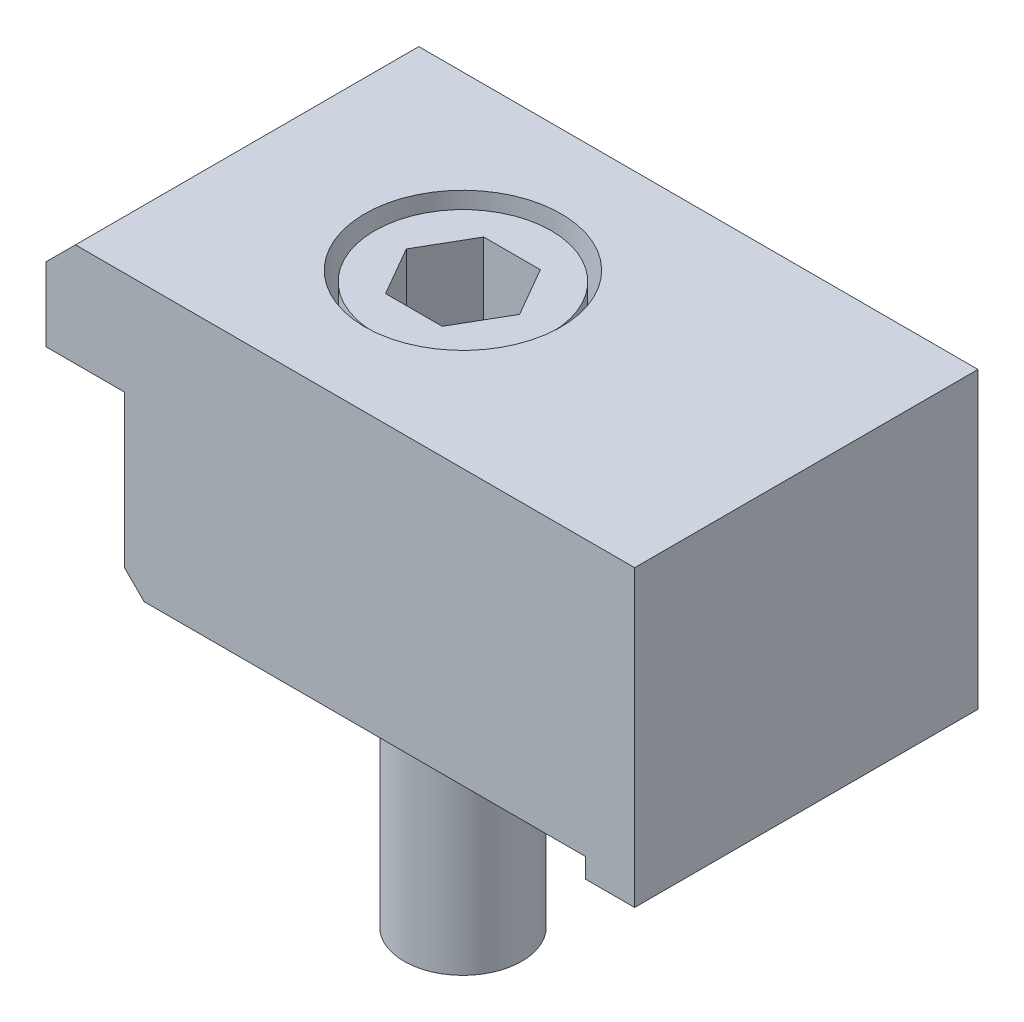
ISO-10303-21;
HEADER;
FILE_DESCRIPTION(('STEP AP214'),'2;1');
FILE_NAME('part.step','',(''),(''),'','','');
FILE_SCHEMA(('AUTOMOTIVE_DESIGN { 1 0 10303 214 1 1 1 1 }'));
ENDSEC;
DATA;
#1=APPLICATION_CONTEXT('core data for automotive mechanical design processes');
#2=APPLICATION_PROTOCOL_DEFINITION('international standard','automotive_design',2000,#1);
#3=PRODUCT_CONTEXT('',#1,'mechanical');
#4=PRODUCT('Part','Part','',(#3));
#5=PRODUCT_RELATED_PRODUCT_CATEGORY('part','',(#4));
#6=PRODUCT_DEFINITION_FORMATION('','',#4);
#7=PRODUCT_DEFINITION_CONTEXT('part definition',#1,'design');
#8=PRODUCT_DEFINITION('design','',#6,#7);
#9=PRODUCT_DEFINITION_SHAPE('','',#8);
#10=(LENGTH_UNIT() NAMED_UNIT(*) SI_UNIT(.MILLI.,.METRE.));
#11=(NAMED_UNIT(*) PLANE_ANGLE_UNIT() SI_UNIT($,.RADIAN.));
#12=(NAMED_UNIT(*) SI_UNIT($,.STERADIAN.) SOLID_ANGLE_UNIT());
#13=UNCERTAINTY_MEASURE_WITH_UNIT(LENGTH_MEASURE(1.E-05),#10,'distance_accuracy_value','');
#14=(GEOMETRIC_REPRESENTATION_CONTEXT(3) GLOBAL_UNCERTAINTY_ASSIGNED_CONTEXT((#13)) GLOBAL_UNIT_ASSIGNED_CONTEXT((#10,
#11,#12)) REPRESENTATION_CONTEXT('',''));
#15=CARTESIAN_POINT('',(0.,0.,0.));
#16=DIRECTION('',(0.,0.,1.));
#17=DIRECTION('',(1.,0.,0.));
#18=AXIS2_PLACEMENT_3D('',#15,#16,#17);
#19=CARTESIAN_POINT('',(-25.,0.,17.5));
#20=DIRECTION('',(0.,0.,1.));
#21=DIRECTION('',(1.,0.,0.));
#22=AXIS2_PLACEMENT_3D('',#19,#20,#21);
#23=PLANE('',#22);
#24=DIRECTION('',(1.,0.,0.));
#25=VECTOR('',#24,1.);
#26=CARTESIAN_POINT('',(-25.,30.,17.5));
#27=LINE('',#26,#25);
#28=CARTESIAN_POINT('',(-22.,30.,17.5));
#29=VERTEX_POINT('',#28);
#30=CARTESIAN_POINT('',(35.,30.,17.5));
#31=VERTEX_POINT('',#30);
#32=EDGE_CURVE('E231',#29,#31,#27,.T.);
#33=ORIENTED_EDGE('',*,*,#32,.F.);
#34=DIRECTION('',(0.707106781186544,0.707106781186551,0.));
#35=VECTOR('',#34,1.);
#36=CARTESIAN_POINT('',(-38.5,13.4999999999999,17.5));
#37=LINE('',#36,#35);
#38=CARTESIAN_POINT('',(-25.,27.,17.5));
#39=VERTEX_POINT('',#38);
#40=EDGE_CURVE('E40',#29,#39,#37,.F.);
#41=ORIENTED_EDGE('',*,*,#40,.T.);
#42=DIRECTION('',(0.,1.,0.));
#43=VECTOR('',#42,1.);
#44=CARTESIAN_POINT('',(-25.,0.,17.5));
#45=LINE('',#44,#43);
#46=CARTESIAN_POINT('',(-25.,19.5,17.5));
#47=VERTEX_POINT('',#46);
#48=EDGE_CURVE('E249',#47,#39,#45,.T.);
#49=ORIENTED_EDGE('',*,*,#48,.F.);
#50=DIRECTION('',(1.,0.,0.));
#51=VECTOR('',#50,1.);
#52=CARTESIAN_POINT('',(-25.,19.5,17.5));
#53=LINE('',#52,#51);
#54=CARTESIAN_POINT('',(-17.,19.5,17.5));
#55=VERTEX_POINT('',#54);
#56=EDGE_CURVE('E217',#47,#55,#53,.T.);
#57=ORIENTED_EDGE('',*,*,#56,.T.);
#58=DIRECTION('',(0.,-1.,0.));
#59=VECTOR('',#58,1.);
#60=CARTESIAN_POINT('',(-17.,19.5,17.5));
#61=LINE('',#60,#59);
#62=CARTESIAN_POINT('',(-17.,4.,17.5));
#63=VERTEX_POINT('',#62);
#64=EDGE_CURVE('E220',#55,#63,#61,.T.);
#65=ORIENTED_EDGE('',*,*,#64,.T.);
#66=DIRECTION('',(-0.707106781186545,0.70710678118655,0.));
#67=VECTOR('',#66,1.);
#68=CARTESIAN_POINT('',(-19.,6.,17.5));
#69=LINE('',#68,#67);
#70=CARTESIAN_POINT('',(-15.,2.,17.5));
#71=VERTEX_POINT('',#70);
#72=EDGE_CURVE('E267',#63,#71,#69,.F.);
#73=ORIENTED_EDGE('',*,*,#72,.T.);
#74=DIRECTION('',(1.,0.,0.));
#75=VECTOR('',#74,1.);
#76=CARTESIAN_POINT('',(-17.,2.,17.5));
#77=LINE('',#76,#75);
#78=CARTESIAN_POINT('',(30.,2.,17.5));
#79=VERTEX_POINT('',#78);
#80=EDGE_CURVE('E202',#71,#79,#77,.T.);
#81=ORIENTED_EDGE('',*,*,#80,.T.);
#82=DIRECTION('',(0.,-1.,0.));
#83=VECTOR('',#82,1.);
#84=CARTESIAN_POINT('',(30.,2.,17.5));
#85=LINE('',#84,#83);
#86=CARTESIAN_POINT('',(30.,0.,17.5));
#87=VERTEX_POINT('',#86);
#88=EDGE_CURVE('E204',#79,#87,#85,.T.);
#89=ORIENTED_EDGE('',*,*,#88,.T.);
#90=DIRECTION('',(1.,0.,0.));
#91=VECTOR('',#90,1.);
#92=CARTESIAN_POINT('',(-25.,0.,17.5));
#93=LINE('',#92,#91);
#94=CARTESIAN_POINT('',(35.,0.,17.5));
#95=VERTEX_POINT('',#94);
#96=EDGE_CURVE('E233',#87,#95,#93,.T.);
#97=ORIENTED_EDGE('',*,*,#96,.T.);
#98=DIRECTION('',(0.,1.,0.));
#99=VECTOR('',#98,1.);
#100=CARTESIAN_POINT('',(35.,0.,17.5));
#101=LINE('',#100,#99);
#102=EDGE_CURVE('E242',#95,#31,#101,.T.);
#103=ORIENTED_EDGE('',*,*,#102,.T.);
#104=EDGE_LOOP('',(#33,#41,#49,#57,#65,#73,#81,#89,#97,#103));
#105=FACE_BOUND('',#104,.T.);
#106=ADVANCED_FACE('F17',(#105),#23,.T.);
#107=CARTESIAN_POINT('',(-25.,0.,-17.5));
#108=DIRECTION('',(-1.,0.,0.));
#109=DIRECTION('',(0.,0.,1.));
#110=AXIS2_PLACEMENT_3D('',#107,#108,#109);
#111=PLANE('',#110);
#112=ORIENTED_EDGE('',*,*,#48,.T.);
#113=DIRECTION('',(0.,0.,-1.));
#114=VECTOR('',#113,1.);
#115=CARTESIAN_POINT('',(-25.,27.,-17.5));
#116=LINE('',#115,#114);
#117=CARTESIAN_POINT('',(-25.,27.,-17.5));
#118=VERTEX_POINT('',#117);
#119=EDGE_CURVE('E26',#39,#118,#116,.T.);
#120=ORIENTED_EDGE('',*,*,#119,.T.);
#121=DIRECTION('',(0.,1.,0.));
#122=VECTOR('',#121,1.);
#123=CARTESIAN_POINT('',(-25.,0.,-17.5));
#124=LINE('',#123,#122);
#125=CARTESIAN_POINT('',(-25.,19.5,-17.5));
#126=VERTEX_POINT('',#125);
#127=EDGE_CURVE('E252',#126,#118,#124,.T.);
#128=ORIENTED_EDGE('',*,*,#127,.F.);
#129=DIRECTION('',(0.,0.,-1.));
#130=VECTOR('',#129,1.);
#131=CARTESIAN_POINT('',(-25.,19.5,17.5));
#132=LINE('',#131,#130);
#133=EDGE_CURVE('E224',#47,#126,#132,.T.);
#134=ORIENTED_EDGE('',*,*,#133,.F.);
#135=EDGE_LOOP('',(#112,#120,#128,#134));
#136=FACE_BOUND('',#135,.T.);
#137=ADVANCED_FACE('F298',(#136),#111,.T.);
#138=CARTESIAN_POINT('',(35.,0.,-17.5));
#139=DIRECTION('',(0.,0.,-1.));
#140=DIRECTION('',(-1.,0.,0.));
#141=AXIS2_PLACEMENT_3D('',#138,#139,#140);
#142=PLANE('',#141);
#143=ORIENTED_EDGE('',*,*,#127,.T.);
#144=DIRECTION('',(-0.707106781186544,-0.707106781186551,0.));
#145=VECTOR('',#144,1.);
#146=CARTESIAN_POINT('',(-8.50000000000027,43.5,-17.5));
#147=LINE('',#146,#145);
#148=CARTESIAN_POINT('',(-22.,30.,-17.5));
#149=VERTEX_POINT('',#148);
#150=EDGE_CURVE('E11',#118,#149,#147,.F.);
#151=ORIENTED_EDGE('',*,*,#150,.T.);
#152=DIRECTION('',(-1.,0.,0.));
#153=VECTOR('',#152,1.);
#154=CARTESIAN_POINT('',(35.,30.,-17.5));
#155=LINE('',#154,#153);
#156=CARTESIAN_POINT('',(35.,30.,-17.5));
#157=VERTEX_POINT('',#156);
#158=EDGE_CURVE('E236',#157,#149,#155,.T.);
#159=ORIENTED_EDGE('',*,*,#158,.F.);
#160=DIRECTION('',(0.,1.,0.));
#161=VECTOR('',#160,1.);
#162=CARTESIAN_POINT('',(35.,0.,-17.5));
#163=LINE('',#162,#161);
#164=CARTESIAN_POINT('',(35.,0.,-17.5));
#165=VERTEX_POINT('',#164);
#166=EDGE_CURVE('E254',#165,#157,#163,.T.);
#167=ORIENTED_EDGE('',*,*,#166,.F.);
#168=DIRECTION('',(-1.,0.,0.));
#169=VECTOR('',#168,1.);
#170=CARTESIAN_POINT('',(35.,0.,-17.5));
#171=LINE('',#170,#169);
#172=CARTESIAN_POINT('',(30.,0.,-17.5));
#173=VERTEX_POINT('',#172);
#174=EDGE_CURVE('E239',#165,#173,#171,.T.);
#175=ORIENTED_EDGE('',*,*,#174,.T.);
#176=DIRECTION('',(0.,-1.,0.));
#177=VECTOR('',#176,1.);
#178=CARTESIAN_POINT('',(30.,2.,-17.5));
#179=LINE('',#178,#177);
#180=CARTESIAN_POINT('',(30.,2.,-17.5));
#181=VERTEX_POINT('',#180);
#182=EDGE_CURVE('E205',#181,#173,#179,.T.);
#183=ORIENTED_EDGE('',*,*,#182,.F.);
#184=DIRECTION('',(1.,0.,0.));
#185=VECTOR('',#184,1.);
#186=CARTESIAN_POINT('',(-17.,2.,-17.5));
#187=LINE('',#186,#185);
#188=CARTESIAN_POINT('',(-15.,2.,-17.5));
#189=VERTEX_POINT('',#188);
#190=EDGE_CURVE('E201',#189,#181,#187,.T.);
#191=ORIENTED_EDGE('',*,*,#190,.F.);
#192=DIRECTION('',(0.707106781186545,-0.70710678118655,0.));
#193=VECTOR('',#192,1.);
#194=CARTESIAN_POINT('',(10.9999999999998,-24.,-17.5));
#195=LINE('',#194,#193);
#196=CARTESIAN_POINT('',(-17.,4.,-17.5));
#197=VERTEX_POINT('',#196);
#198=EDGE_CURVE('E263',#189,#197,#195,.F.);
#199=ORIENTED_EDGE('',*,*,#198,.T.);
#200=DIRECTION('',(0.,-1.,0.));
#201=VECTOR('',#200,1.);
#202=CARTESIAN_POINT('',(-17.,19.5,-17.5));
#203=LINE('',#202,#201);
#204=CARTESIAN_POINT('',(-17.,19.5,-17.5));
#205=VERTEX_POINT('',#204);
#206=EDGE_CURVE('E221',#205,#197,#203,.T.);
#207=ORIENTED_EDGE('',*,*,#206,.F.);
#208=DIRECTION('',(1.,0.,0.));
#209=VECTOR('',#208,1.);
#210=CARTESIAN_POINT('',(-25.,19.5,-17.5));
#211=LINE('',#210,#209);
#212=EDGE_CURVE('E214',#126,#205,#211,.T.);
#213=ORIENTED_EDGE('',*,*,#212,.F.);
#214=EDGE_LOOP('',(#143,#151,#159,#167,#175,#183,#191,#199,#207,#213));
#215=FACE_BOUND('',#214,.T.);
#216=ADVANCED_FACE('F286',(#215),#142,.T.);
#217=CARTESIAN_POINT('',(35.,0.,17.5));
#218=DIRECTION('',(1.,0.,0.));
#219=DIRECTION('',(0.,0.,-1.));
#220=AXIS2_PLACEMENT_3D('',#217,#218,#219);
#221=PLANE('',#220);
#222=DIRECTION('',(0.,0.,-1.));
#223=VECTOR('',#222,1.);
#224=CARTESIAN_POINT('',(35.,30.,17.5));
#225=LINE('',#224,#223);
#226=EDGE_CURVE('E244',#31,#157,#225,.T.);
#227=ORIENTED_EDGE('',*,*,#226,.F.);
#228=ORIENTED_EDGE('',*,*,#102,.F.);
#229=DIRECTION('',(0.,0.,-1.));
#230=VECTOR('',#229,1.);
#231=CARTESIAN_POINT('',(35.,0.,17.5));
#232=LINE('',#231,#230);
#233=EDGE_CURVE('E235',#95,#165,#232,.T.);
#234=ORIENTED_EDGE('',*,*,#233,.T.);
#235=ORIENTED_EDGE('',*,*,#166,.T.);
#236=EDGE_LOOP('',(#227,#228,#234,#235));
#237=FACE_BOUND('',#236,.T.);
#238=ADVANCED_FACE('F283',(#237),#221,.T.);
#239=CARTESIAN_POINT('',(0.,0.,0.));
#240=DIRECTION('',(0.,1.,0.));
#241=DIRECTION('',(0.,0.,1.));
#242=AXIS2_PLACEMENT_3D('',#239,#240,#241);
#243=PLANE('',#242);
#244=ORIENTED_EDGE('',*,*,#96,.F.);
#245=DIRECTION('',(0.,0.,-1.));
#246=VECTOR('',#245,1.);
#247=CARTESIAN_POINT('',(30.,0.,17.5));
#248=LINE('',#247,#246);
#249=EDGE_CURVE('E211',#87,#173,#248,.T.);
#250=ORIENTED_EDGE('',*,*,#249,.T.);
#251=ORIENTED_EDGE('',*,*,#174,.F.);
#252=ORIENTED_EDGE('',*,*,#233,.F.);
#253=EDGE_LOOP('',(#244,#250,#251,#252));
#254=FACE_BOUND('',#253,.T.);
#255=ADVANCED_FACE('F316',(#254),#243,.F.);
#256=CARTESIAN_POINT('',(0.,30.,0.));
#257=DIRECTION('',(0.,1.,0.));
#258=DIRECTION('',(0.,0.,1.));
#259=AXIS2_PLACEMENT_3D('',#256,#257,#258);
#260=PLANE('',#259);
#261=CARTESIAN_POINT('',(0.,30.,0.));
#262=DIRECTION('',(0.,1.,0.));
#263=DIRECTION('',(0.,0.,1.));
#264=AXIS2_PLACEMENT_3D('',#261,#262,#263);
#265=CIRCLE('',#264,10.);
#266=CARTESIAN_POINT('',(0.,30.,10.));
#267=VERTEX_POINT('',#266);
#268=EDGE_CURVE('E195',#267,#267,#265,.T.);
#269=ORIENTED_EDGE('',*,*,#268,.F.);
#270=EDGE_LOOP('',(#269));
#271=FACE_BOUND('',#270,.T.);
#272=ORIENTED_EDGE('',*,*,#158,.T.);
#273=DIRECTION('',(0.,0.,1.));
#274=VECTOR('',#273,1.);
#275=CARTESIAN_POINT('',(-22.,30.,0.));
#276=LINE('',#275,#274);
#277=EDGE_CURVE('E269',#149,#29,#276,.T.);
#278=ORIENTED_EDGE('',*,*,#277,.T.);
#279=ORIENTED_EDGE('',*,*,#32,.T.);
#280=ORIENTED_EDGE('',*,*,#226,.T.);
#281=EDGE_LOOP('',(#272,#278,#279,#280));
#282=FACE_BOUND('',#281,.T.);
#283=ADVANCED_FACE('F274',(#271,#282),#260,.T.);
#284=CARTESIAN_POINT('',(-17.,19.5,17.5));
#285=DIRECTION('',(1.,0.,0.));
#286=DIRECTION('',(0.,0.,-1.));
#287=AXIS2_PLACEMENT_3D('',#284,#285,#286);
#288=PLANE('',#287);
#289=ORIENTED_EDGE('',*,*,#206,.T.);
#290=DIRECTION('',(0.,0.,1.));
#291=VECTOR('',#290,1.);
#292=CARTESIAN_POINT('',(-17.,4.,17.5));
#293=LINE('',#292,#291);
#294=EDGE_CURVE('E265',#197,#63,#293,.T.);
#295=ORIENTED_EDGE('',*,*,#294,.T.);
#296=ORIENTED_EDGE('',*,*,#64,.F.);
#297=DIRECTION('',(0.,0.,-1.));
#298=VECTOR('',#297,1.);
#299=CARTESIAN_POINT('',(-17.,19.5,17.5));
#300=LINE('',#299,#298);
#301=EDGE_CURVE('E229',#55,#205,#300,.T.);
#302=ORIENTED_EDGE('',*,*,#301,.T.);
#303=EDGE_LOOP('',(#289,#295,#296,#302));
#304=FACE_BOUND('',#303,.T.);
#305=ADVANCED_FACE('F321',(#304),#288,.F.);
#306=CARTESIAN_POINT('',(-25.,19.5,17.5));
#307=DIRECTION('',(0.,1.,0.));
#308=DIRECTION('',(0.,0.,1.));
#309=AXIS2_PLACEMENT_3D('',#306,#307,#308);
#310=PLANE('',#309);
#311=ORIENTED_EDGE('',*,*,#212,.T.);
#312=ORIENTED_EDGE('',*,*,#301,.F.);
#313=ORIENTED_EDGE('',*,*,#56,.F.);
#314=ORIENTED_EDGE('',*,*,#133,.T.);
#315=EDGE_LOOP('',(#311,#312,#313,#314));
#316=FACE_BOUND('',#315,.T.);
#317=ADVANCED_FACE('F326',(#316),#310,.F.);
#318=CARTESIAN_POINT('',(30.,2.,17.5));
#319=DIRECTION('',(1.,0.,0.));
#320=DIRECTION('',(0.,0.,-1.));
#321=AXIS2_PLACEMENT_3D('',#318,#319,#320);
#322=PLANE('',#321);
#323=ORIENTED_EDGE('',*,*,#182,.T.);
#324=ORIENTED_EDGE('',*,*,#249,.F.);
#325=ORIENTED_EDGE('',*,*,#88,.F.);
#326=DIRECTION('',(0.,0.,-1.));
#327=VECTOR('',#326,1.);
#328=CARTESIAN_POINT('',(30.,2.,17.5));
#329=LINE('',#328,#327);
#330=EDGE_CURVE('E208',#79,#181,#329,.T.);
#331=ORIENTED_EDGE('',*,*,#330,.T.);
#332=EDGE_LOOP('',(#323,#324,#325,#331));
#333=FACE_BOUND('',#332,.T.);
#334=ADVANCED_FACE('F329',(#333),#322,.F.);
#335=CARTESIAN_POINT('',(-17.,2.,17.5));
#336=DIRECTION('',(0.,1.,0.));
#337=DIRECTION('',(0.,0.,1.));
#338=AXIS2_PLACEMENT_3D('',#335,#336,#337);
#339=PLANE('',#338);
#340=CARTESIAN_POINT('',(0.,2.,0.));
#341=DIRECTION('',(0.,-1.,0.));
#342=DIRECTION('',(0.,0.,-1.));
#343=AXIS2_PLACEMENT_3D('',#340,#341,#342);
#344=CIRCLE('',#343,6.5);
#345=CARTESIAN_POINT('',(0.,2.,-6.5));
#346=VERTEX_POINT('',#345);
#347=EDGE_CURVE('E399',#346,#346,#344,.T.);
#348=ORIENTED_EDGE('',*,*,#347,.F.);
#349=EDGE_LOOP('',(#348));
#350=FACE_BOUND('',#349,.T.);
#351=ORIENTED_EDGE('',*,*,#80,.F.);
#352=DIRECTION('',(0.,0.,-1.));
#353=VECTOR('',#352,1.);
#354=CARTESIAN_POINT('',(-15.,2.,17.5));
#355=LINE('',#354,#353);
#356=EDGE_CURVE('E260',#71,#189,#355,.T.);
#357=ORIENTED_EDGE('',*,*,#356,.T.);
#358=ORIENTED_EDGE('',*,*,#190,.T.);
#359=ORIENTED_EDGE('',*,*,#330,.F.);
#360=EDGE_LOOP('',(#351,#357,#358,#359));
#361=FACE_BOUND('',#360,.T.);
#362=ADVANCED_FACE('F334',(#350,#361),#339,.F.);
#363=CARTESIAN_POINT('',(0.,17.,0.));
#364=DIRECTION('',(0.,-1.,0.));
#365=DIRECTION('',(0.,0.,-1.));
#366=AXIS2_PLACEMENT_3D('',#363,#364,#365);
#367=PLANE('',#366);
#368=CARTESIAN_POINT('',(0.,17.,0.));
#369=DIRECTION('',(0.,-1.,0.));
#370=DIRECTION('',(0.,0.,-1.));
#371=AXIS2_PLACEMENT_3D('',#368,#369,#370);
#372=CIRCLE('',#371,9.);
#373=CARTESIAN_POINT('',(0.,17.,-9.));
#374=VERTEX_POINT('',#373);
#375=EDGE_CURVE('E251',#374,#374,#372,.F.);
#376=ORIENTED_EDGE('',*,*,#375,.F.);
#377=EDGE_LOOP('',(#376));
#378=FACE_BOUND('',#377,.T.);
#379=CARTESIAN_POINT('',(0.,17.,0.));
#380=DIRECTION('',(0.,1.,0.));
#381=DIRECTION('',(0.,0.,1.));
#382=AXIS2_PLACEMENT_3D('',#379,#380,#381);
#383=CIRCLE('',#382,10.);
#384=CARTESIAN_POINT('',(0.,17.,10.));
#385=VERTEX_POINT('',#384);
#386=EDGE_CURVE('E198',#385,#385,#383,.T.);
#387=ORIENTED_EDGE('',*,*,#386,.T.);
#388=EDGE_LOOP('',(#387));
#389=FACE_BOUND('',#388,.T.);
#390=ADVANCED_FACE('F337',(#378,#389),#367,.F.);
#391=CARTESIAN_POINT('',(0.,30.,0.));
#392=DIRECTION('',(0.,1.,0.));
#393=DIRECTION('',(0.,0.,1.));
#394=AXIS2_PLACEMENT_3D('',#391,#392,#393);
#395=CYLINDRICAL_SURFACE('',#394,10.);
#396=ORIENTED_EDGE('',*,*,#386,.F.);
#397=EDGE_LOOP('',(#396));
#398=FACE_BOUND('',#397,.T.);
#399=ORIENTED_EDGE('',*,*,#268,.T.);
#400=EDGE_LOOP('',(#399));
#401=FACE_BOUND('',#400,.T.);
#402=ADVANCED_FACE('F344',(#398,#401),#395,.F.);
#403=CARTESIAN_POINT('',(0.,29.,0.));
#404=DIRECTION('',(0.,-1.,0.));
#405=DIRECTION('',(0.,0.,-1.));
#406=AXIS2_PLACEMENT_3D('',#403,#404,#405);
#407=CYLINDRICAL_SURFACE('',#406,9.);
#408=CARTESIAN_POINT('',(0.,29.,0.));
#409=DIRECTION('',(0.,1.,0.));
#410=DIRECTION('',(0.,0.,1.));
#411=AXIS2_PLACEMENT_3D('',#408,#409,#410);
#412=CIRCLE('',#411,9.);
#413=CARTESIAN_POINT('',(0.,29.,9.));
#414=VERTEX_POINT('',#413);
#415=EDGE_CURVE('E185',#414,#414,#412,.T.);
#416=ORIENTED_EDGE('',*,*,#415,.F.);
#417=EDGE_LOOP('',(#416));
#418=FACE_BOUND('',#417,.T.);
#419=ORIENTED_EDGE('',*,*,#375,.T.);
#420=EDGE_LOOP('',(#419));
#421=FACE_BOUND('',#420,.T.);
#422=ADVANCED_FACE('F348',(#418,#421),#407,.T.);
#423=CARTESIAN_POINT('',(0.,29.,0.));
#424=DIRECTION('',(0.,1.,0.));
#425=DIRECTION('',(0.,0.,1.));
#426=AXIS2_PLACEMENT_3D('',#423,#424,#425);
#427=PLANE('',#426);
#428=DIRECTION('',(0.5,0.,-0.866025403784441));
#429=VECTOR('',#428,1.);
#430=CARTESIAN_POINT('',(2.88675134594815,29.,5.));
#431=LINE('',#430,#429);
#432=CARTESIAN_POINT('',(2.88675134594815,29.,5.));
#433=VERTEX_POINT('',#432);
#434=CARTESIAN_POINT('',(5.77350269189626,29.,0.));
#435=VERTEX_POINT('',#434);
#436=EDGE_CURVE('E138',#433,#435,#431,.T.);
#437=ORIENTED_EDGE('',*,*,#436,.F.);
#438=DIRECTION('',(1.,0.,0.));
#439=VECTOR('',#438,1.);
#440=CARTESIAN_POINT('',(-2.88675134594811,29.,5.));
#441=LINE('',#440,#439);
#442=CARTESIAN_POINT('',(-2.88675134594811,29.,5.));
#443=VERTEX_POINT('',#442);
#444=EDGE_CURVE('E156',#443,#433,#441,.T.);
#445=ORIENTED_EDGE('',*,*,#444,.F.);
#446=DIRECTION('',(0.5,0.,0.866025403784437));
#447=VECTOR('',#446,1.);
#448=CARTESIAN_POINT('',(-5.77350269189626,29.,0.));
#449=LINE('',#448,#447);
#450=CARTESIAN_POINT('',(-5.77350269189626,29.,0.));
#451=VERTEX_POINT('',#450);
#452=EDGE_CURVE('E159',#451,#443,#449,.T.);
#453=ORIENTED_EDGE('',*,*,#452,.F.);
#454=DIRECTION('',(-0.5,0.,0.866025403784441));
#455=VECTOR('',#454,1.);
#456=CARTESIAN_POINT('',(-2.88675134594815,29.,-5.));
#457=LINE('',#456,#455);
#458=CARTESIAN_POINT('',(-2.88675134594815,29.,-5.));
#459=VERTEX_POINT('',#458);
#460=EDGE_CURVE('E178',#459,#451,#457,.T.);
#461=ORIENTED_EDGE('',*,*,#460,.F.);
#462=DIRECTION('',(-1.,0.,0.));
#463=VECTOR('',#462,1.);
#464=CARTESIAN_POINT('',(2.88675134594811,29.,-5.));
#465=LINE('',#464,#463);
#466=CARTESIAN_POINT('',(2.88675134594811,29.,-5.));
#467=VERTEX_POINT('',#466);
#468=EDGE_CURVE('E175',#467,#459,#465,.T.);
#469=ORIENTED_EDGE('',*,*,#468,.F.);
#470=DIRECTION('',(-0.5,0.,-0.866025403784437));
#471=VECTOR('',#470,1.);
#472=CARTESIAN_POINT('',(5.77350269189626,29.,0.));
#473=LINE('',#472,#471);
#474=EDGE_CURVE('E173',#435,#467,#473,.T.);
#475=ORIENTED_EDGE('',*,*,#474,.F.);
#476=EDGE_LOOP('',(#437,#445,#453,#461,#469,#475));
#477=FACE_BOUND('',#476,.T.);
#478=ORIENTED_EDGE('',*,*,#415,.T.);
#479=EDGE_LOOP('',(#478));
#480=FACE_BOUND('',#479,.T.);
#481=ADVANCED_FACE('F352',(#477,#480),#427,.T.);
#482=CARTESIAN_POINT('',(2.88675134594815,20.48,5.));
#483=DIRECTION('',(0.866025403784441,0.,0.5));
#484=DIRECTION('',(0.5,0.,-0.866025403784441));
#485=AXIS2_PLACEMENT_3D('',#482,#483,#484);
#486=PLANE('',#485);
#487=ORIENTED_EDGE('',*,*,#436,.T.);
#488=DIRECTION('',(0.,1.,0.));
#489=VECTOR('',#488,1.);
#490=CARTESIAN_POINT('',(5.77350269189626,20.48,0.));
#491=LINE('',#490,#489);
#492=CARTESIAN_POINT('',(5.77350269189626,20.48,0.));
#493=VERTEX_POINT('',#492);
#494=EDGE_CURVE('E131',#493,#435,#491,.T.);
#495=ORIENTED_EDGE('',*,*,#494,.F.);
#496=DIRECTION('',(0.5,0.,-0.866025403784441));
#497=VECTOR('',#496,1.);
#498=CARTESIAN_POINT('',(2.88675134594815,20.48,5.));
#499=LINE('',#498,#497);
#500=CARTESIAN_POINT('',(2.88675134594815,20.48,5.));
#501=VERTEX_POINT('',#500);
#502=EDGE_CURVE('E135',#501,#493,#499,.T.);
#503=ORIENTED_EDGE('',*,*,#502,.F.);
#504=DIRECTION('',(0.,1.,0.));
#505=VECTOR('',#504,1.);
#506=CARTESIAN_POINT('',(2.88675134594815,20.48,5.));
#507=LINE('',#506,#505);
#508=EDGE_CURVE('E183',#501,#433,#507,.T.);
#509=ORIENTED_EDGE('',*,*,#508,.T.);
#510=EDGE_LOOP('',(#487,#495,#503,#509));
#511=FACE_BOUND('',#510,.T.);
#512=ADVANCED_FACE('F133',(#511),#486,.F.);
#513=CARTESIAN_POINT('',(-2.88675134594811,20.48,5.));
#514=DIRECTION('',(0.,0.,1.));
#515=DIRECTION('',(1.,0.,0.));
#516=AXIS2_PLACEMENT_3D('',#513,#514,#515);
#517=PLANE('',#516);
#518=ORIENTED_EDGE('',*,*,#444,.T.);
#519=ORIENTED_EDGE('',*,*,#508,.F.);
#520=DIRECTION('',(1.,0.,0.));
#521=VECTOR('',#520,1.);
#522=CARTESIAN_POINT('',(-2.88675134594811,20.48,5.));
#523=LINE('',#522,#521);
#524=CARTESIAN_POINT('',(-2.88675134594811,20.48,5.));
#525=VERTEX_POINT('',#524);
#526=EDGE_CURVE('E143',#525,#501,#523,.T.);
#527=ORIENTED_EDGE('',*,*,#526,.F.);
#528=DIRECTION('',(0.,1.,0.));
#529=VECTOR('',#528,1.);
#530=CARTESIAN_POINT('',(-2.88675134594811,20.48,5.));
#531=LINE('',#530,#529);
#532=EDGE_CURVE('E186',#525,#443,#531,.T.);
#533=ORIENTED_EDGE('',*,*,#532,.T.);
#534=EDGE_LOOP('',(#518,#519,#527,#533));
#535=FACE_BOUND('',#534,.T.);
#536=ADVANCED_FACE('F359',(#535),#517,.F.);
#537=CARTESIAN_POINT('',(-5.77350269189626,20.48,0.));
#538=DIRECTION('',(-0.866025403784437,0.,0.5));
#539=DIRECTION('',(0.5,0.,0.866025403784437));
#540=AXIS2_PLACEMENT_3D('',#537,#538,#539);
#541=PLANE('',#540);
#542=ORIENTED_EDGE('',*,*,#452,.T.);
#543=ORIENTED_EDGE('',*,*,#532,.F.);
#544=DIRECTION('',(0.5,0.,0.866025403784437));
#545=VECTOR('',#544,1.);
#546=CARTESIAN_POINT('',(-5.77350269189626,20.48,0.));
#547=LINE('',#546,#545);
#548=CARTESIAN_POINT('',(-5.77350269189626,20.48,0.));
#549=VERTEX_POINT('',#548);
#550=EDGE_CURVE('E169',#549,#525,#547,.T.);
#551=ORIENTED_EDGE('',*,*,#550,.F.);
#552=DIRECTION('',(0.,1.,0.));
#553=VECTOR('',#552,1.);
#554=CARTESIAN_POINT('',(-5.77350269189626,20.48,0.));
#555=LINE('',#554,#553);
#556=EDGE_CURVE('E188',#549,#451,#555,.T.);
#557=ORIENTED_EDGE('',*,*,#556,.T.);
#558=EDGE_LOOP('',(#542,#543,#551,#557));
#559=FACE_BOUND('',#558,.T.);
#560=ADVANCED_FACE('F369',(#559),#541,.F.);
#561=CARTESIAN_POINT('',(-2.88675134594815,20.48,-5.));
#562=DIRECTION('',(-0.866025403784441,0.,-0.5));
#563=DIRECTION('',(-0.5,0.,0.866025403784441));
#564=AXIS2_PLACEMENT_3D('',#561,#562,#563);
#565=PLANE('',#564);
#566=ORIENTED_EDGE('',*,*,#460,.T.);
#567=ORIENTED_EDGE('',*,*,#556,.F.);
#568=DIRECTION('',(-0.5,0.,0.866025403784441));
#569=VECTOR('',#568,1.);
#570=CARTESIAN_POINT('',(-2.88675134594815,20.48,-5.));
#571=LINE('',#570,#569);
#572=CARTESIAN_POINT('',(-2.88675134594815,20.48,-5.));
#573=VERTEX_POINT('',#572);
#574=EDGE_CURVE('E166',#573,#549,#571,.T.);
#575=ORIENTED_EDGE('',*,*,#574,.F.);
#576=DIRECTION('',(0.,1.,0.));
#577=VECTOR('',#576,1.);
#578=CARTESIAN_POINT('',(-2.88675134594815,20.48,-5.));
#579=LINE('',#578,#577);
#580=EDGE_CURVE('E190',#573,#459,#579,.T.);
#581=ORIENTED_EDGE('',*,*,#580,.T.);
#582=EDGE_LOOP('',(#566,#567,#575,#581));
#583=FACE_BOUND('',#582,.T.);
#584=ADVANCED_FACE('F365',(#583),#565,.F.);
#585=CARTESIAN_POINT('',(2.88675134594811,20.48,-5.));
#586=DIRECTION('',(0.,0.,-1.));
#587=DIRECTION('',(-1.,0.,0.));
#588=AXIS2_PLACEMENT_3D('',#585,#586,#587);
#589=PLANE('',#588);
#590=ORIENTED_EDGE('',*,*,#468,.T.);
#591=ORIENTED_EDGE('',*,*,#580,.F.);
#592=DIRECTION('',(-1.,0.,0.));
#593=VECTOR('',#592,1.);
#594=CARTESIAN_POINT('',(2.88675134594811,20.48,-5.));
#595=LINE('',#594,#593);
#596=CARTESIAN_POINT('',(2.88675134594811,20.48,-5.));
#597=VERTEX_POINT('',#596);
#598=EDGE_CURVE('E151',#597,#573,#595,.T.);
#599=ORIENTED_EDGE('',*,*,#598,.F.);
#600=DIRECTION('',(0.,1.,0.));
#601=VECTOR('',#600,1.);
#602=CARTESIAN_POINT('',(2.88675134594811,20.48,-5.));
#603=LINE('',#602,#601);
#604=EDGE_CURVE('E142',#597,#467,#603,.T.);
#605=ORIENTED_EDGE('',*,*,#604,.T.);
#606=EDGE_LOOP('',(#590,#591,#599,#605));
#607=FACE_BOUND('',#606,.T.);
#608=ADVANCED_FACE('F362',(#607),#589,.F.);
#609=CARTESIAN_POINT('',(5.77350269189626,20.48,0.));
#610=DIRECTION('',(0.866025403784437,0.,-0.5));
#611=DIRECTION('',(-0.5,0.,-0.866025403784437));
#612=AXIS2_PLACEMENT_3D('',#609,#610,#611);
#613=PLANE('',#612);
#614=ORIENTED_EDGE('',*,*,#474,.T.);
#615=ORIENTED_EDGE('',*,*,#604,.F.);
#616=DIRECTION('',(-0.5,0.,-0.866025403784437));
#617=VECTOR('',#616,1.);
#618=CARTESIAN_POINT('',(5.77350269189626,20.48,0.));
#619=LINE('',#618,#617);
#620=EDGE_CURVE('E146',#493,#597,#619,.T.);
#621=ORIENTED_EDGE('',*,*,#620,.F.);
#622=ORIENTED_EDGE('',*,*,#494,.T.);
#623=EDGE_LOOP('',(#614,#615,#621,#622));
#624=FACE_BOUND('',#623,.T.);
#625=ADVANCED_FACE('F147',(#624),#613,.F.);
#626=CARTESIAN_POINT('',(0.,20.48,0.));
#627=DIRECTION('',(0.,1.,0.));
#628=DIRECTION('',(0.,0.,1.));
#629=AXIS2_PLACEMENT_3D('',#626,#627,#628);
#630=PLANE('',#629);
#631=ORIENTED_EDGE('',*,*,#502,.T.);
#632=ORIENTED_EDGE('',*,*,#620,.T.);
#633=ORIENTED_EDGE('',*,*,#598,.T.);
#634=ORIENTED_EDGE('',*,*,#574,.T.);
#635=ORIENTED_EDGE('',*,*,#550,.T.);
#636=ORIENTED_EDGE('',*,*,#526,.T.);
#637=EDGE_LOOP('',(#631,#632,#633,#634,#635,#636));
#638=FACE_BOUND('',#637,.T.);
#639=ADVANCED_FACE('F153',(#638),#630,.T.);
#640=CARTESIAN_POINT('',(0.,17.,0.));
#641=DIRECTION('',(0.,1.,0.));
#642=DIRECTION('',(0.,0.,1.));
#643=AXIS2_PLACEMENT_3D('',#640,#641,#642);
#644=PLANE('',#643);
#645=CARTESIAN_POINT('',(0.,17.,0.));
#646=DIRECTION('',(0.,1.,0.));
#647=DIRECTION('',(-1.,0.,0.));
#648=AXIS2_PLACEMENT_3D('',#645,#646,#647);
#649=CIRCLE('',#648,6.);
#650=CARTESIAN_POINT('',(-6.,17.,0.));
#651=VERTEX_POINT('',#650);
#652=EDGE_CURVE('E400',#651,#651,#649,.T.);
#653=ORIENTED_EDGE('',*,*,#652,.T.);
#654=EDGE_LOOP('',(#653));
#655=FACE_BOUND('',#654,.T.);
#656=CARTESIAN_POINT('',(0.,17.,0.));
#657=DIRECTION('',(0.,-1.,0.));
#658=DIRECTION('',(0.,0.,-1.));
#659=AXIS2_PLACEMENT_3D('',#656,#657,#658);
#660=CIRCLE('',#659,6.5);
#661=CARTESIAN_POINT('',(0.,17.,-6.5));
#662=VERTEX_POINT('',#661);
#663=EDGE_CURVE('E162',#662,#662,#660,.T.);
#664=ORIENTED_EDGE('',*,*,#663,.T.);
#665=EDGE_LOOP('',(#664));
#666=FACE_BOUND('',#665,.T.);
#667=ADVANCED_FACE('F379',(#655,#666),#644,.F.);
#668=CARTESIAN_POINT('',(0.,2.,0.));
#669=DIRECTION('',(0.,-1.,0.));
#670=DIRECTION('',(0.,0.,-1.));
#671=AXIS2_PLACEMENT_3D('',#668,#669,#670);
#672=CYLINDRICAL_SURFACE('',#671,6.5);
#673=ORIENTED_EDGE('',*,*,#663,.F.);
#674=EDGE_LOOP('',(#673));
#675=FACE_BOUND('',#674,.T.);
#676=ORIENTED_EDGE('',*,*,#347,.T.);
#677=EDGE_LOOP('',(#676));
#678=FACE_BOUND('',#677,.T.);
#679=ADVANCED_FACE('F382',(#675,#678),#672,.F.);
#680=CARTESIAN_POINT('',(0.,-28.,0.));
#681=DIRECTION('',(0.,1.,0.));
#682=DIRECTION('',(-1.,0.,0.));
#683=AXIS2_PLACEMENT_3D('',#680,#681,#682);
#684=CYLINDRICAL_SURFACE('',#683,6.);
#685=CARTESIAN_POINT('',(0.,-28.,0.));
#686=DIRECTION('',(0.,1.,0.));
#687=DIRECTION('',(-1.,0.,0.));
#688=AXIS2_PLACEMENT_3D('',#685,#686,#687);
#689=CIRCLE('',#688,6.);
#690=CARTESIAN_POINT('',(-6.,-28.,0.));
#691=VERTEX_POINT('',#690);
#692=EDGE_CURVE('E398',#691,#691,#689,.T.);
#693=ORIENTED_EDGE('',*,*,#692,.T.);
#694=EDGE_LOOP('',(#693));
#695=FACE_BOUND('',#694,.T.);
#696=ORIENTED_EDGE('',*,*,#652,.F.);
#697=EDGE_LOOP('',(#696));
#698=FACE_BOUND('',#697,.T.);
#699=ADVANCED_FACE('F386',(#695,#698),#684,.T.);
#700=CARTESIAN_POINT('',(6.,-28.,0.));
#701=DIRECTION('',(0.,-1.,0.));
#702=DIRECTION('',(1.,0.,0.));
#703=AXIS2_PLACEMENT_3D('',#700,#701,#702);
#704=PLANE('',#703);
#705=ORIENTED_EDGE('',*,*,#692,.F.);
#706=EDGE_LOOP('',(#705));
#707=FACE_BOUND('',#706,.T.);
#708=ADVANCED_FACE('F295',(#707),#704,.T.);
#709=CARTESIAN_POINT('',(-15.,2.,17.5));
#710=DIRECTION('',(0.70710678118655,0.707106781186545,0.));
#711=DIRECTION('',(0.,0.,-1.));
#712=AXIS2_PLACEMENT_3D('',#709,#710,#711);
#713=PLANE('',#712);
#714=ORIENTED_EDGE('',*,*,#72,.F.);
#715=ORIENTED_EDGE('',*,*,#294,.F.);
#716=ORIENTED_EDGE('',*,*,#198,.F.);
#717=ORIENTED_EDGE('',*,*,#356,.F.);
#718=EDGE_LOOP('',(#714,#715,#716,#717));
#719=FACE_BOUND('',#718,.T.);
#720=ADVANCED_FACE('F289',(#719),#713,.F.);
#721=CARTESIAN_POINT('',(-22.,30.,0.));
#722=DIRECTION('',(0.707106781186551,-0.707106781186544,0.));
#723=DIRECTION('',(0.,0.,1.));
#724=AXIS2_PLACEMENT_3D('',#721,#722,#723);
#725=PLANE('',#724);
#726=ORIENTED_EDGE('',*,*,#150,.F.);
#727=ORIENTED_EDGE('',*,*,#119,.F.);
#728=ORIENTED_EDGE('',*,*,#40,.F.);
#729=ORIENTED_EDGE('',*,*,#277,.F.);
#730=EDGE_LOOP('',(#726,#727,#728,#729));
#731=FACE_BOUND('',#730,.T.);
#732=ADVANCED_FACE('F20',(#731),#725,.F.);
#733=CLOSED_SHELL('',(#106,#137,#216,#238,#255,#283,#305,#317,#334,#362,#390,#402,#422,#481,
#512,#536,#560,#584,#608,#625,#639,#667,#679,#699,#708,#720,#732));
#734=MANIFOLD_SOLID_BREP('B1',#733);
#735=ADVANCED_BREP_SHAPE_REPRESENTATION('',(#18,#734),#14);
#736=SHAPE_DEFINITION_REPRESENTATION(#9,#735);
ENDSEC;
END-ISO-10303-21;
